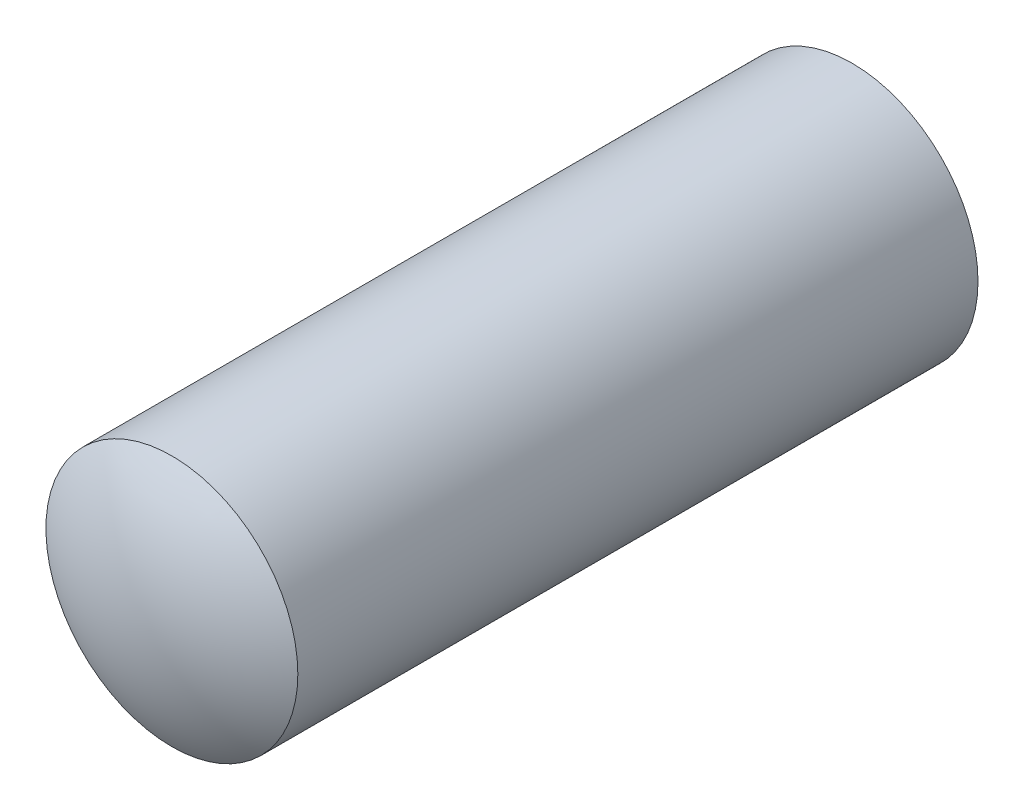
from build123d import *


with BuildPart() as part:
    # E_corps → Corps (revolve)
    with BuildSketch(Plane(origin=(0, 0, 0), x_dir=(0, 0, -1), z_dir=(1, 0, 0)), mode=Mode.PRIVATE) as corps_sk:
        with BuildLine():
            Line((0, 0), (24, 0))
            ThreePointArc((24, 0), (23.693537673, 2.088061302), (22.8, 4))
            Line((22.8, 4), (1.2, 4))
            ThreePointArc((1.2, 4), (0.306462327, 2.088061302), (0, 0))
        make_face()
    revolve(corps_sk.sketch.rotate(Axis((0, 0, 10.722897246), (0, 0, -1)), 90), axis=Axis((0, 0, 10.722897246), (0, 0, -1)))


solid = part.part
